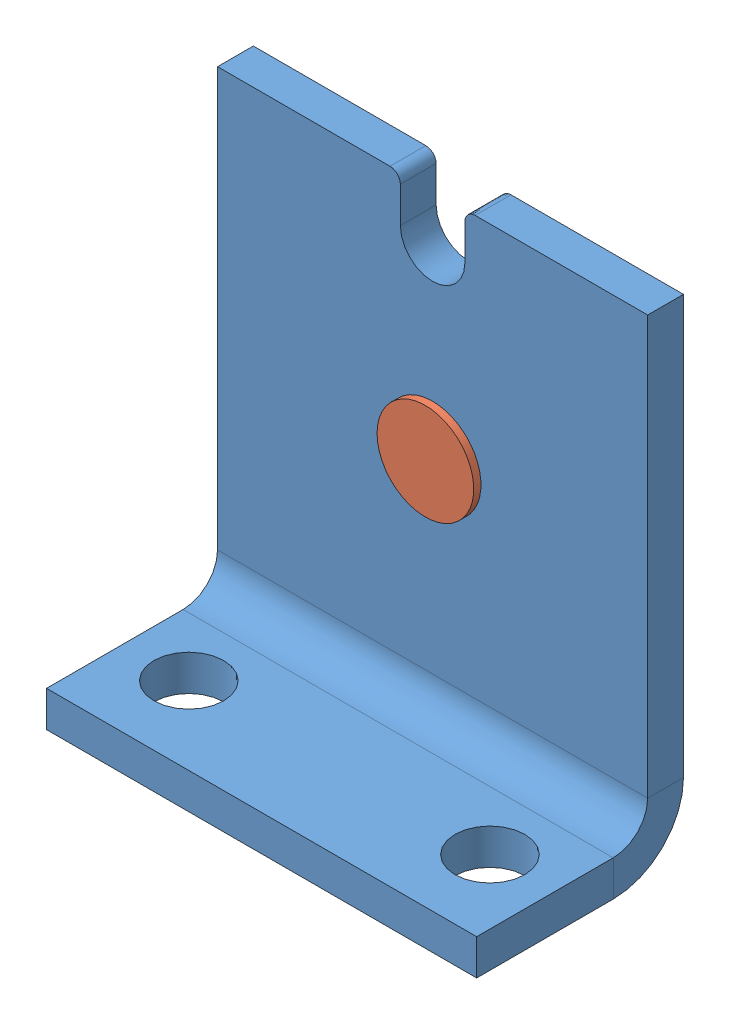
SolidWorks assembly Coil Stop A-11397.SLDASM, configuration Default (file format 8000). Lengths in mm.
Overall size (31.75 36.07 18.26).
2 component instances, 2 part files, 2 mates.
Components (placement in the parent):
- Coil Stop sys11 Droptarget-1: Coil Stop sys11 Droptarget.SLDPRT [Default] at origin size (31.75 36.07 15.27)
- Coil Stop Button SYS11 Droptarget-1: Coil Stop Button SYS11 Droptarget.SLDPRT [Default] at (0 1.016 -2.6416) size (11.18 11.18 6.17)
Mates (geometry in assembly coordinates):
- Coincident1: coincident anti-aligned: plane of Coil Stop sys11 Droptarget-1 through (0 0 -2.6416) normal (0 0 -1); plane of Coil Stop Button SYS11 Droptarget-1 through (0 1.016 -2.6416) normal (0 0 1)
- Concentric1: concentric aligned: cylinder of Coil Stop sys11 Droptarget-1 through (0 1.016 0) axis (0 0 -1) radius 3.5687; cylinder of Coil Stop Button SYS11 Droptarget-1 through (0 1.016 0.5334) axis (0 0 -1) radius 3.5687
